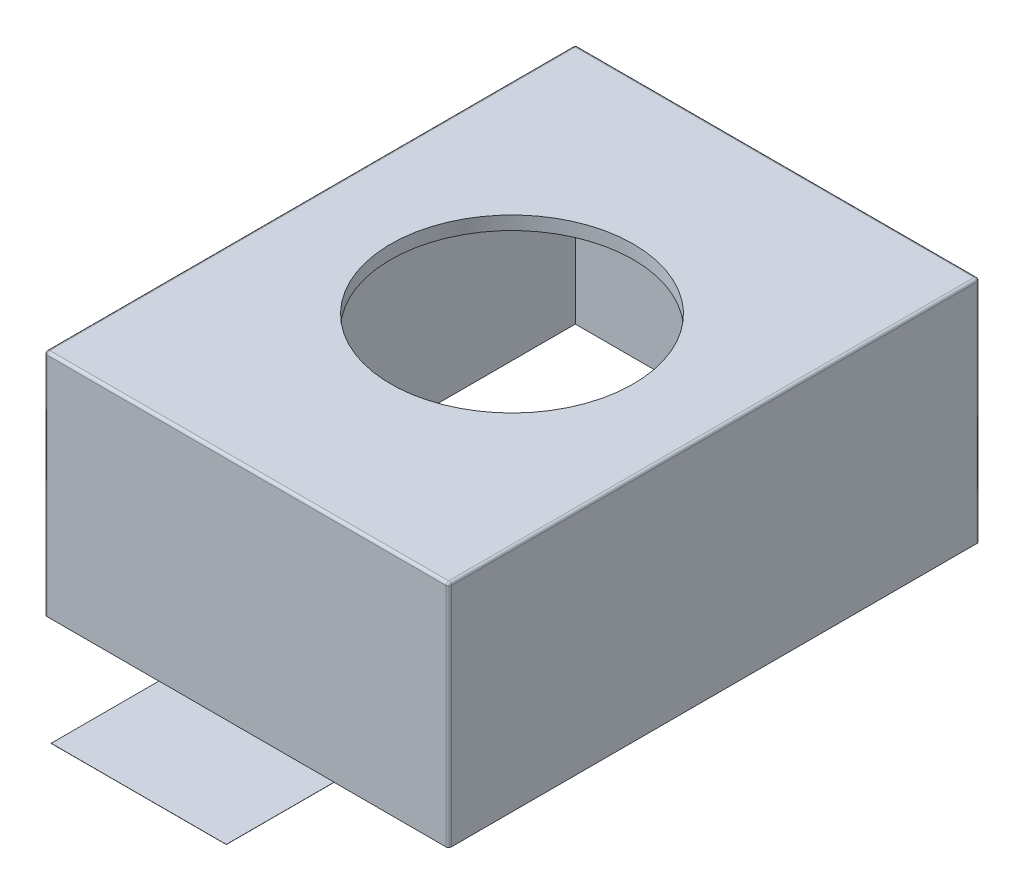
ISO-10303-21;
HEADER;
FILE_DESCRIPTION(('STEP AP214'),'2;1');
FILE_NAME('part.step','',(''),(''),'','','');
FILE_SCHEMA(('AUTOMOTIVE_DESIGN { 1 0 10303 214 1 1 1 1 }'));
ENDSEC;
DATA;
#1=APPLICATION_CONTEXT('core data for automotive mechanical design processes');
#2=APPLICATION_PROTOCOL_DEFINITION('international standard','automotive_design',2000,#1);
#3=PRODUCT_CONTEXT('',#1,'mechanical');
#4=PRODUCT('Part','Part','',(#3));
#5=PRODUCT_RELATED_PRODUCT_CATEGORY('part','',(#4));
#6=PRODUCT_DEFINITION_FORMATION('','',#4);
#7=PRODUCT_DEFINITION_CONTEXT('part definition',#1,'design');
#8=PRODUCT_DEFINITION('design','',#6,#7);
#9=PRODUCT_DEFINITION_SHAPE('','',#8);
#10=(LENGTH_UNIT() NAMED_UNIT(*) SI_UNIT(.MILLI.,.METRE.));
#11=(NAMED_UNIT(*) PLANE_ANGLE_UNIT() SI_UNIT($,.RADIAN.));
#12=(NAMED_UNIT(*) SI_UNIT($,.STERADIAN.) SOLID_ANGLE_UNIT());
#13=UNCERTAINTY_MEASURE_WITH_UNIT(LENGTH_MEASURE(1.E-05),#10,'distance_accuracy_value','');
#14=(GEOMETRIC_REPRESENTATION_CONTEXT(3) GLOBAL_UNCERTAINTY_ASSIGNED_CONTEXT((#13)) GLOBAL_UNIT_ASSIGNED_CONTEXT((#10,
#11,#12)) REPRESENTATION_CONTEXT('',''));
#15=CARTESIAN_POINT('',(0.,0.,0.));
#16=DIRECTION('',(0.,0.,1.));
#17=DIRECTION('',(1.,0.,0.));
#18=AXIS2_PLACEMENT_3D('',#15,#16,#17);
#19=CARTESIAN_POINT('',(5.6,1.65,23.8));
#20=DIRECTION('',(0.,0.,1.));
#21=DIRECTION('',(1.,0.,0.));
#22=AXIS2_PLACEMENT_3D('',#19,#20,#21);
#23=PLANE('',#22);
#24=DIRECTION('',(0.,1.,0.));
#25=VECTOR('',#24,1.);
#26=CARTESIAN_POINT('',(5.6,1.65,23.8));
#27=LINE('',#26,#25);
#28=CARTESIAN_POINT('',(5.6,1.65,23.8));
#29=VERTEX_POINT('',#28);
#30=CARTESIAN_POINT('',(5.6,1.651,23.8));
#31=VERTEX_POINT('',#30);
#32=EDGE_CURVE('E20',#29,#31,#27,.T.);
#33=ORIENTED_EDGE('',*,*,#32,.F.);
#34=DIRECTION('',(1.,0.,0.));
#35=VECTOR('',#34,1.);
#36=CARTESIAN_POINT('',(6.25,1.65,23.8));
#37=LINE('',#36,#35);
#38=CARTESIAN_POINT('',(6.9,1.65,23.8));
#39=VERTEX_POINT('',#38);
#40=EDGE_CURVE('E152',#29,#39,#37,.T.);
#41=ORIENTED_EDGE('',*,*,#40,.T.);
#42=DIRECTION('',(0.,1.,0.));
#43=VECTOR('',#42,1.);
#44=CARTESIAN_POINT('',(6.9,1.65,23.8));
#45=LINE('',#44,#43);
#46=CARTESIAN_POINT('',(6.9,1.651,23.8));
#47=VERTEX_POINT('',#46);
#48=EDGE_CURVE('E259',#47,#39,#45,.F.);
#49=ORIENTED_EDGE('',*,*,#48,.F.);
#50=DIRECTION('',(1.,0.,0.));
#51=VECTOR('',#50,1.);
#52=CARTESIAN_POINT('',(6.25,1.651,23.8));
#53=LINE('',#52,#51);
#54=EDGE_CURVE('E154',#47,#31,#53,.F.);
#55=ORIENTED_EDGE('',*,*,#54,.T.);
#56=EDGE_LOOP('',(#33,#41,#49,#55));
#57=FACE_BOUND('',#56,.T.);
#58=ADVANCED_FACE('F17',(#57),#23,.T.);
#59=CARTESIAN_POINT('',(6.9,1.65,18.26));
#60=DIRECTION('',(0.,0.,-1.));
#61=DIRECTION('',(-1.,0.,0.));
#62=AXIS2_PLACEMENT_3D('',#59,#60,#61);
#63=PLANE('',#62);
#64=DIRECTION('',(0.,1.,0.));
#65=VECTOR('',#64,1.);
#66=CARTESIAN_POINT('',(6.9,1.65,18.26));
#67=LINE('',#66,#65);
#68=CARTESIAN_POINT('',(6.9,1.65,18.26));
#69=VERTEX_POINT('',#68);
#70=CARTESIAN_POINT('',(6.9,1.651,18.26));
#71=VERTEX_POINT('',#70);
#72=EDGE_CURVE('E179',#69,#71,#67,.T.);
#73=ORIENTED_EDGE('',*,*,#72,.F.);
#74=DIRECTION('',(1.,0.,0.));
#75=VECTOR('',#74,1.);
#76=CARTESIAN_POINT('',(6.25,1.65,18.26));
#77=LINE('',#76,#75);
#78=CARTESIAN_POINT('',(5.6,1.65,18.26));
#79=VERTEX_POINT('',#78);
#80=EDGE_CURVE('E175',#69,#79,#77,.F.);
#81=ORIENTED_EDGE('',*,*,#80,.T.);
#82=DIRECTION('',(0.,1.,0.));
#83=VECTOR('',#82,1.);
#84=CARTESIAN_POINT('',(5.6,1.65,18.26));
#85=LINE('',#84,#83);
#86=CARTESIAN_POINT('',(5.6,1.651,18.26));
#87=VERTEX_POINT('',#86);
#88=EDGE_CURVE('E164',#87,#79,#85,.F.);
#89=ORIENTED_EDGE('',*,*,#88,.F.);
#90=DIRECTION('',(1.,0.,0.));
#91=VECTOR('',#90,1.);
#92=CARTESIAN_POINT('',(6.25,1.651,18.26));
#93=LINE('',#92,#91);
#94=EDGE_CURVE('E176',#87,#71,#93,.T.);
#95=ORIENTED_EDGE('',*,*,#94,.T.);
#96=EDGE_LOOP('',(#73,#81,#89,#95));
#97=FACE_BOUND('',#96,.T.);
#98=ADVANCED_FACE('F385',(#97),#63,.T.);
#99=CARTESIAN_POINT('',(5.6,1.65,23.));
#100=DIRECTION('',(-1.,0.,0.));
#101=DIRECTION('',(0.,0.,1.));
#102=AXIS2_PLACEMENT_3D('',#99,#100,#101);
#103=PLANE('',#102);
#104=DIRECTION('',(0.,1.,0.));
#105=VECTOR('',#104,1.);
#106=CARTESIAN_POINT('',(5.6,1.65,23.));
#107=LINE('',#106,#105);
#108=CARTESIAN_POINT('',(5.6,1.65,23.));
#109=VERTEX_POINT('',#108);
#110=CARTESIAN_POINT('',(5.6,1.651,23.));
#111=VERTEX_POINT('',#110);
#112=EDGE_CURVE('E161',#109,#111,#107,.T.);
#113=ORIENTED_EDGE('',*,*,#112,.F.);
#114=DIRECTION('',(0.,0.,1.));
#115=VECTOR('',#114,1.);
#116=CARTESIAN_POINT('',(5.6,1.65,21.03));
#117=LINE('',#116,#115);
#118=EDGE_CURVE('E158',#109,#29,#117,.T.);
#119=ORIENTED_EDGE('',*,*,#118,.T.);
#120=ORIENTED_EDGE('',*,*,#32,.T.);
#121=DIRECTION('',(0.,0.,-1.));
#122=VECTOR('',#121,1.);
#123=CARTESIAN_POINT('',(5.6,1.651,18.66));
#124=LINE('',#123,#122);
#125=EDGE_CURVE('E180',#31,#111,#124,.T.);
#126=ORIENTED_EDGE('',*,*,#125,.T.);
#127=EDGE_LOOP('',(#113,#119,#120,#126));
#128=FACE_BOUND('',#127,.T.);
#129=ADVANCED_FACE('F159',(#128),#103,.T.);
#130=CARTESIAN_POINT('',(6.25,1.651,18.66));
#131=DIRECTION('',(0.,-1.,0.));
#132=DIRECTION('',(0.,0.,-1.));
#133=AXIS2_PLACEMENT_3D('',#130,#131,#132);
#134=PLANE('',#133);
#135=ORIENTED_EDGE('',*,*,#54,.F.);
#136=DIRECTION('',(0.,0.,-1.));
#137=VECTOR('',#136,1.);
#138=CARTESIAN_POINT('',(6.9,1.651,23.8));
#139=LINE('',#138,#137);
#140=CARTESIAN_POINT('',(6.9,1.651,23.));
#141=VERTEX_POINT('',#140);
#142=EDGE_CURVE('E260',#141,#47,#139,.F.);
#143=ORIENTED_EDGE('',*,*,#142,.F.);
#144=DIRECTION('',(1.,0.,0.));
#145=VECTOR('',#144,1.);
#146=CARTESIAN_POINT('',(4.75,1.651,23.));
#147=LINE('',#146,#145);
#148=EDGE_CURVE('E239',#111,#141,#147,.T.);
#149=ORIENTED_EDGE('',*,*,#148,.F.);
#150=ORIENTED_EDGE('',*,*,#125,.F.);
#151=EDGE_LOOP('',(#135,#143,#149,#150));
#152=FACE_BOUND('',#151,.T.);
#153=ADVANCED_FACE('F380',(#152),#134,.F.);
#154=CARTESIAN_POINT('',(6.9,1.65,23.8));
#155=DIRECTION('',(1.,0.,0.));
#156=DIRECTION('',(0.,0.,-1.));
#157=AXIS2_PLACEMENT_3D('',#154,#155,#156);
#158=PLANE('',#157);
#159=ORIENTED_EDGE('',*,*,#48,.T.);
#160=DIRECTION('',(0.,0.,1.));
#161=VECTOR('',#160,1.);
#162=CARTESIAN_POINT('',(6.9,1.65,21.03));
#163=LINE('',#162,#161);
#164=CARTESIAN_POINT('',(6.9,1.65,23.));
#165=VERTEX_POINT('',#164);
#166=EDGE_CURVE('E169',#39,#165,#163,.F.);
#167=ORIENTED_EDGE('',*,*,#166,.T.);
#168=DIRECTION('',(0.,1.,0.));
#169=VECTOR('',#168,1.);
#170=CARTESIAN_POINT('',(6.9,1.65,23.));
#171=LINE('',#170,#169);
#172=EDGE_CURVE('E235',#141,#165,#171,.F.);
#173=ORIENTED_EDGE('',*,*,#172,.F.);
#174=ORIENTED_EDGE('',*,*,#142,.T.);
#175=EDGE_LOOP('',(#159,#167,#173,#174));
#176=FACE_BOUND('',#175,.T.);
#177=ADVANCED_FACE('F376',(#176),#158,.T.);
#178=CARTESIAN_POINT('',(7.73,1.65,22.98));
#179=DIRECTION('',(0.,1.,0.));
#180=DIRECTION('',(0.,0.,1.));
#181=AXIS2_PLACEMENT_3D('',#178,#179,#180);
#182=CYLINDRICAL_SURFACE('',#181,0.02);
#183=DIRECTION('',(0.,1.,0.));
#184=VECTOR('',#183,1.);
#185=CARTESIAN_POINT('',(7.73,1.65,23.));
#186=LINE('',#185,#184);
#187=CARTESIAN_POINT('',(7.73,1.65,23.));
#188=VERTEX_POINT('',#187);
#189=CARTESIAN_POINT('',(7.73,3.33,23.));
#190=VERTEX_POINT('',#189);
#191=EDGE_CURVE('E305',#188,#190,#186,.T.);
#192=ORIENTED_EDGE('',*,*,#191,.F.);
#193=CARTESIAN_POINT('',(7.73,1.65,22.98));
#194=DIRECTION('',(0.,1.,0.));
#195=DIRECTION('',(0.,0.,1.));
#196=AXIS2_PLACEMENT_3D('',#193,#194,#195);
#197=CIRCLE('',#196,0.02);
#198=CARTESIAN_POINT('',(7.75,1.65,22.98));
#199=VERTEX_POINT('',#198);
#200=EDGE_CURVE('E171',#188,#199,#197,.T.);
#201=ORIENTED_EDGE('',*,*,#200,.T.);
#202=DIRECTION('',(0.,1.,0.));
#203=VECTOR('',#202,1.);
#204=CARTESIAN_POINT('',(7.75,1.65,22.98));
#205=LINE('',#204,#203);
#206=CARTESIAN_POINT('',(7.75,3.33,22.98));
#207=VERTEX_POINT('',#206);
#208=EDGE_CURVE('E229',#207,#199,#205,.F.);
#209=ORIENTED_EDGE('',*,*,#208,.F.);
#210=CARTESIAN_POINT('',(7.73,3.33,22.98));
#211=DIRECTION('',(0.,1.,0.));
#212=DIRECTION('',(0.,0.,1.));
#213=AXIS2_PLACEMENT_3D('',#210,#211,#212);
#214=CIRCLE('',#213,0.02);
#215=EDGE_CURVE('E230',#190,#207,#214,.T.);
#216=ORIENTED_EDGE('',*,*,#215,.F.);
#217=EDGE_LOOP('',(#192,#201,#209,#216));
#218=FACE_BOUND('',#217,.T.);
#219=ADVANCED_FACE('F372',(#218),#182,.T.);
#220=CARTESIAN_POINT('',(7.73,1.65,19.08));
#221=DIRECTION('',(0.,1.,0.));
#222=DIRECTION('',(0.,0.,1.));
#223=AXIS2_PLACEMENT_3D('',#220,#221,#222);
#224=CYLINDRICAL_SURFACE('',#223,0.02);
#225=DIRECTION('',(0.,1.,0.));
#226=VECTOR('',#225,1.);
#227=CARTESIAN_POINT('',(7.75,1.65,19.08));
#228=LINE('',#227,#226);
#229=CARTESIAN_POINT('',(7.75,1.65,19.08));
#230=VERTEX_POINT('',#229);
#231=CARTESIAN_POINT('',(7.75,3.33,19.08));
#232=VERTEX_POINT('',#231);
#233=EDGE_CURVE('E269',#230,#232,#228,.T.);
#234=ORIENTED_EDGE('',*,*,#233,.F.);
#235=CARTESIAN_POINT('',(7.73,1.65,19.08));
#236=DIRECTION('',(0.,1.,0.));
#237=DIRECTION('',(0.,0.,1.));
#238=AXIS2_PLACEMENT_3D('',#235,#236,#237);
#239=CIRCLE('',#238,0.02);
#240=CARTESIAN_POINT('',(7.73,1.65,19.06));
#241=VERTEX_POINT('',#240);
#242=EDGE_CURVE('E251',#230,#241,#239,.T.);
#243=ORIENTED_EDGE('',*,*,#242,.T.);
#244=DIRECTION('',(0.,1.,0.));
#245=VECTOR('',#244,1.);
#246=CARTESIAN_POINT('',(7.73,1.65,19.06));
#247=LINE('',#246,#245);
#248=CARTESIAN_POINT('',(7.73,3.33,19.06));
#249=VERTEX_POINT('',#248);
#250=EDGE_CURVE('E228',#249,#241,#247,.F.);
#251=ORIENTED_EDGE('',*,*,#250,.F.);
#252=CARTESIAN_POINT('',(7.73,3.33,19.08));
#253=DIRECTION('',(0.,1.,0.));
#254=DIRECTION('',(0.,0.,1.));
#255=AXIS2_PLACEMENT_3D('',#252,#253,#254);
#256=CIRCLE('',#255,0.02);
#257=EDGE_CURVE('E225',#232,#249,#256,.T.);
#258=ORIENTED_EDGE('',*,*,#257,.F.);
#259=EDGE_LOOP('',(#234,#243,#251,#258));
#260=FACE_BOUND('',#259,.T.);
#261=ADVANCED_FACE('F368',(#260),#224,.T.);
#262=CARTESIAN_POINT('',(6.9,1.65,19.06));
#263=DIRECTION('',(1.,0.,0.));
#264=DIRECTION('',(0.,0.,-1.));
#265=AXIS2_PLACEMENT_3D('',#262,#263,#264);
#266=PLANE('',#265);
#267=DIRECTION('',(0.,1.,0.));
#268=VECTOR('',#267,1.);
#269=CARTESIAN_POINT('',(6.9,1.65,19.06));
#270=LINE('',#269,#268);
#271=CARTESIAN_POINT('',(6.9,1.65,19.06));
#272=VERTEX_POINT('',#271);
#273=CARTESIAN_POINT('',(6.9,1.651,19.06));
#274=VERTEX_POINT('',#273);
#275=EDGE_CURVE('E221',#272,#274,#270,.T.);
#276=ORIENTED_EDGE('',*,*,#275,.F.);
#277=DIRECTION('',(0.,0.,1.));
#278=VECTOR('',#277,1.);
#279=CARTESIAN_POINT('',(6.9,1.65,21.03));
#280=LINE('',#279,#278);
#281=EDGE_CURVE('E253',#272,#69,#280,.F.);
#282=ORIENTED_EDGE('',*,*,#281,.T.);
#283=ORIENTED_EDGE('',*,*,#72,.T.);
#284=DIRECTION('',(0.,0.,-1.));
#285=VECTOR('',#284,1.);
#286=CARTESIAN_POINT('',(6.9,1.651,18.66));
#287=LINE('',#286,#285);
#288=EDGE_CURVE('E178',#71,#274,#287,.F.);
#289=ORIENTED_EDGE('',*,*,#288,.T.);
#290=EDGE_LOOP('',(#276,#282,#283,#289));
#291=FACE_BOUND('',#290,.T.);
#292=ADVANCED_FACE('F364',(#291),#266,.T.);
#293=CARTESIAN_POINT('',(6.25,1.651,18.66));
#294=DIRECTION('',(0.,-1.,0.));
#295=DIRECTION('',(0.,0.,-1.));
#296=AXIS2_PLACEMENT_3D('',#293,#294,#295);
#297=PLANE('',#296);
#298=ORIENTED_EDGE('',*,*,#94,.F.);
#299=DIRECTION('',(0.,0.,1.));
#300=VECTOR('',#299,1.);
#301=CARTESIAN_POINT('',(5.6,1.651,18.26));
#302=LINE('',#301,#300);
#303=CARTESIAN_POINT('',(5.6,1.651,19.06));
#304=VERTEX_POINT('',#303);
#305=EDGE_CURVE('E257',#304,#87,#302,.F.);
#306=ORIENTED_EDGE('',*,*,#305,.F.);
#307=DIRECTION('',(-1.,0.,0.));
#308=VECTOR('',#307,1.);
#309=CARTESIAN_POINT('',(7.75,1.651,19.06));
#310=LINE('',#309,#308);
#311=EDGE_CURVE('E220',#274,#304,#310,.T.);
#312=ORIENTED_EDGE('',*,*,#311,.F.);
#313=ORIENTED_EDGE('',*,*,#288,.F.);
#314=EDGE_LOOP('',(#298,#306,#312,#313));
#315=FACE_BOUND('',#314,.T.);
#316=ADVANCED_FACE('F360',(#315),#297,.F.);
#317=CARTESIAN_POINT('',(5.6,1.65,18.26));
#318=DIRECTION('',(-1.,0.,0.));
#319=DIRECTION('',(0.,0.,1.));
#320=AXIS2_PLACEMENT_3D('',#317,#318,#319);
#321=PLANE('',#320);
#322=ORIENTED_EDGE('',*,*,#88,.T.);
#323=DIRECTION('',(0.,0.,1.));
#324=VECTOR('',#323,1.);
#325=CARTESIAN_POINT('',(5.6,1.65,21.03));
#326=LINE('',#325,#324);
#327=CARTESIAN_POINT('',(5.6,1.65,19.06));
#328=VERTEX_POINT('',#327);
#329=EDGE_CURVE('E250',#79,#328,#326,.T.);
#330=ORIENTED_EDGE('',*,*,#329,.T.);
#331=DIRECTION('',(0.,1.,0.));
#332=VECTOR('',#331,1.);
#333=CARTESIAN_POINT('',(5.6,1.65,19.06));
#334=LINE('',#333,#332);
#335=EDGE_CURVE('E216',#304,#328,#334,.F.);
#336=ORIENTED_EDGE('',*,*,#335,.F.);
#337=ORIENTED_EDGE('',*,*,#305,.T.);
#338=EDGE_LOOP('',(#322,#330,#336,#337));
#339=FACE_BOUND('',#338,.T.);
#340=ADVANCED_FACE('F356',(#339),#321,.T.);
#341=CARTESIAN_POINT('',(4.77,1.65,19.08));
#342=DIRECTION('',(0.,1.,0.));
#343=DIRECTION('',(0.,0.,1.));
#344=AXIS2_PLACEMENT_3D('',#341,#342,#343);
#345=CYLINDRICAL_SURFACE('',#344,0.02);
#346=DIRECTION('',(0.,1.,0.));
#347=VECTOR('',#346,1.);
#348=CARTESIAN_POINT('',(4.77,1.65,19.06));
#349=LINE('',#348,#347);
#350=CARTESIAN_POINT('',(4.77,1.65,19.06));
#351=VERTEX_POINT('',#350);
#352=CARTESIAN_POINT('',(4.77,3.33,19.06));
#353=VERTEX_POINT('',#352);
#354=EDGE_CURVE('E215',#351,#353,#349,.T.);
#355=ORIENTED_EDGE('',*,*,#354,.F.);
#356=CARTESIAN_POINT('',(4.77,1.65,19.08));
#357=DIRECTION('',(0.,1.,0.));
#358=DIRECTION('',(0.,0.,1.));
#359=AXIS2_PLACEMENT_3D('',#356,#357,#358);
#360=CIRCLE('',#359,0.02);
#361=CARTESIAN_POINT('',(4.75,1.65,19.08));
#362=VERTEX_POINT('',#361);
#363=EDGE_CURVE('E248',#351,#362,#360,.T.);
#364=ORIENTED_EDGE('',*,*,#363,.T.);
#365=DIRECTION('',(0.,1.,0.));
#366=VECTOR('',#365,1.);
#367=CARTESIAN_POINT('',(4.75,1.65,19.08));
#368=LINE('',#367,#366);
#369=CARTESIAN_POINT('',(4.75,3.33,19.08));
#370=VERTEX_POINT('',#369);
#371=EDGE_CURVE('E214',#370,#362,#368,.F.);
#372=ORIENTED_EDGE('',*,*,#371,.F.);
#373=CARTESIAN_POINT('',(4.77,3.33,19.08));
#374=DIRECTION('',(0.,1.,0.));
#375=DIRECTION('',(0.,0.,1.));
#376=AXIS2_PLACEMENT_3D('',#373,#374,#375);
#377=CIRCLE('',#376,0.02);
#378=EDGE_CURVE('E211',#353,#370,#377,.T.);
#379=ORIENTED_EDGE('',*,*,#378,.F.);
#380=EDGE_LOOP('',(#355,#364,#372,#379));
#381=FACE_BOUND('',#380,.T.);
#382=ADVANCED_FACE('F352',(#381),#345,.T.);
#383=CARTESIAN_POINT('',(6.25,1.65,21.03));
#384=DIRECTION('',(0.,1.,0.));
#385=DIRECTION('',(0.,0.,1.));
#386=AXIS2_PLACEMENT_3D('',#383,#384,#385);
#387=PLANE('',#386);
#388=DIRECTION('',(1.,0.,0.));
#389=VECTOR('',#388,1.);
#390=CARTESIAN_POINT('',(4.75,1.65,22.9));
#391=LINE('',#390,#389);
#392=CARTESIAN_POINT('',(4.85,1.65,22.9));
#393=VERTEX_POINT('',#392);
#394=CARTESIAN_POINT('',(7.65,1.65,22.9));
#395=VERTEX_POINT('',#394);
#396=EDGE_CURVE('E245',#393,#395,#391,.T.);
#397=ORIENTED_EDGE('',*,*,#396,.T.);
#398=DIRECTION('',(0.,0.,-1.));
#399=VECTOR('',#398,1.);
#400=CARTESIAN_POINT('',(7.65,1.65,23.));
#401=LINE('',#400,#399);
#402=CARTESIAN_POINT('',(7.65,1.65,19.16));
#403=VERTEX_POINT('',#402);
#404=EDGE_CURVE('E285',#395,#403,#401,.T.);
#405=ORIENTED_EDGE('',*,*,#404,.T.);
#406=DIRECTION('',(-1.,0.,0.));
#407=VECTOR('',#406,1.);
#408=CARTESIAN_POINT('',(7.75,1.65,19.16));
#409=LINE('',#408,#407);
#410=CARTESIAN_POINT('',(4.85,1.65,19.16));
#411=VERTEX_POINT('',#410);
#412=EDGE_CURVE('E288',#403,#411,#409,.T.);
#413=ORIENTED_EDGE('',*,*,#412,.T.);
#414=DIRECTION('',(0.,0.,1.));
#415=VECTOR('',#414,1.);
#416=CARTESIAN_POINT('',(4.85,1.65,19.06));
#417=LINE('',#416,#415);
#418=EDGE_CURVE('E300',#411,#393,#417,.T.);
#419=ORIENTED_EDGE('',*,*,#418,.T.);
#420=EDGE_LOOP('',(#397,#405,#413,#419));
#421=FACE_BOUND('',#420,.T.);
#422=ORIENTED_EDGE('',*,*,#363,.F.);
#423=DIRECTION('',(-1.,0.,0.));
#424=VECTOR('',#423,1.);
#425=CARTESIAN_POINT('',(7.75,1.65,19.06));
#426=LINE('',#425,#424);
#427=EDGE_CURVE('E219',#328,#351,#426,.T.);
#428=ORIENTED_EDGE('',*,*,#427,.F.);
#429=ORIENTED_EDGE('',*,*,#329,.F.);
#430=ORIENTED_EDGE('',*,*,#80,.F.);
#431=ORIENTED_EDGE('',*,*,#281,.F.);
#432=DIRECTION('',(-1.,0.,0.));
#433=VECTOR('',#432,1.);
#434=CARTESIAN_POINT('',(7.75,1.65,19.06));
#435=LINE('',#434,#433);
#436=EDGE_CURVE('E224',#241,#272,#435,.T.);
#437=ORIENTED_EDGE('',*,*,#436,.F.);
#438=ORIENTED_EDGE('',*,*,#242,.F.);
#439=DIRECTION('',(0.,0.,-1.));
#440=VECTOR('',#439,1.);
#441=CARTESIAN_POINT('',(7.75,1.65,23.));
#442=LINE('',#441,#440);
#443=EDGE_CURVE('E233',#199,#230,#442,.T.);
#444=ORIENTED_EDGE('',*,*,#443,.F.);
#445=ORIENTED_EDGE('',*,*,#200,.F.);
#446=DIRECTION('',(1.,0.,0.));
#447=VECTOR('',#446,1.);
#448=CARTESIAN_POINT('',(4.75,1.65,23.));
#449=LINE('',#448,#447);
#450=EDGE_CURVE('E238',#165,#188,#449,.T.);
#451=ORIENTED_EDGE('',*,*,#450,.F.);
#452=ORIENTED_EDGE('',*,*,#166,.F.);
#453=ORIENTED_EDGE('',*,*,#40,.F.);
#454=ORIENTED_EDGE('',*,*,#118,.F.);
#455=DIRECTION('',(1.,0.,0.));
#456=VECTOR('',#455,1.);
#457=CARTESIAN_POINT('',(4.75,1.65,23.));
#458=LINE('',#457,#456);
#459=CARTESIAN_POINT('',(4.77,1.65,23.));
#460=VERTEX_POINT('',#459);
#461=EDGE_CURVE('E241',#460,#109,#458,.T.);
#462=ORIENTED_EDGE('',*,*,#461,.F.);
#463=CARTESIAN_POINT('',(4.77,1.65,22.98));
#464=DIRECTION('',(0.,1.,0.));
#465=DIRECTION('',(0.,0.,1.));
#466=AXIS2_PLACEMENT_3D('',#463,#464,#465);
#467=CIRCLE('',#466,0.02);
#468=CARTESIAN_POINT('',(4.75,1.65,22.98));
#469=VERTEX_POINT('',#468);
#470=EDGE_CURVE('E242',#469,#460,#467,.T.);
#471=ORIENTED_EDGE('',*,*,#470,.F.);
#472=DIRECTION('',(0.,0.,1.));
#473=VECTOR('',#472,1.);
#474=CARTESIAN_POINT('',(4.75,1.65,19.06));
#475=LINE('',#474,#473);
#476=EDGE_CURVE('E276',#362,#469,#475,.T.);
#477=ORIENTED_EDGE('',*,*,#476,.F.);
#478=EDGE_LOOP('',(#422,#428,#429,#430,#431,#437,#438,#444,#445,#451,#452,#453,#454,#462,#471,#477));
#479=FACE_BOUND('',#478,.T.);
#480=ADVANCED_FACE('F167',(#421,#479),#387,.F.);
#481=CARTESIAN_POINT('',(4.77,1.65,22.98));
#482=DIRECTION('',(0.,1.,0.));
#483=DIRECTION('',(0.,0.,1.));
#484=AXIS2_PLACEMENT_3D('',#481,#482,#483);
#485=CYLINDRICAL_SURFACE('',#484,0.02);
#486=DIRECTION('',(0.,1.,0.));
#487=VECTOR('',#486,1.);
#488=CARTESIAN_POINT('',(4.75,1.65,22.98));
#489=LINE('',#488,#487);
#490=CARTESIAN_POINT('',(4.75,3.33,22.98));
#491=VERTEX_POINT('',#490);
#492=EDGE_CURVE('E279',#469,#491,#489,.T.);
#493=ORIENTED_EDGE('',*,*,#492,.F.);
#494=ORIENTED_EDGE('',*,*,#470,.T.);
#495=DIRECTION('',(0.,1.,0.));
#496=VECTOR('',#495,1.);
#497=CARTESIAN_POINT('',(4.77,1.65,23.));
#498=LINE('',#497,#496);
#499=CARTESIAN_POINT('',(4.77,3.33,23.));
#500=VERTEX_POINT('',#499);
#501=EDGE_CURVE('E234',#500,#460,#498,.F.);
#502=ORIENTED_EDGE('',*,*,#501,.F.);
#503=CARTESIAN_POINT('',(4.77,3.33,22.98));
#504=DIRECTION('',(0.,1.,0.));
#505=DIRECTION('',(0.,0.,1.));
#506=AXIS2_PLACEMENT_3D('',#503,#504,#505);
#507=CIRCLE('',#506,0.02);
#508=EDGE_CURVE('E246',#500,#491,#507,.F.);
#509=ORIENTED_EDGE('',*,*,#508,.T.);
#510=EDGE_LOOP('',(#493,#494,#502,#509));
#511=FACE_BOUND('',#510,.T.);
#512=ADVANCED_FACE('F345',(#511),#485,.T.);
#513=CARTESIAN_POINT('',(4.75,1.65,22.9));
#514=DIRECTION('',(0.,0.,1.));
#515=DIRECTION('',(1.,0.,0.));
#516=AXIS2_PLACEMENT_3D('',#513,#514,#515);
#517=PLANE('',#516);
#518=DIRECTION('',(1.,0.,0.));
#519=VECTOR('',#518,1.);
#520=CARTESIAN_POINT('',(6.25,3.25,22.9));
#521=LINE('',#520,#519);
#522=CARTESIAN_POINT('',(4.85,3.25,22.9));
#523=VERTEX_POINT('',#522);
#524=CARTESIAN_POINT('',(7.65,3.25,22.9));
#525=VERTEX_POINT('',#524);
#526=EDGE_CURVE('E433',#523,#525,#521,.T.);
#527=ORIENTED_EDGE('',*,*,#526,.T.);
#528=DIRECTION('',(0.,1.,0.));
#529=VECTOR('',#528,1.);
#530=CARTESIAN_POINT('',(7.65,1.65,22.9));
#531=LINE('',#530,#529);
#532=EDGE_CURVE('E282',#525,#395,#531,.F.);
#533=ORIENTED_EDGE('',*,*,#532,.T.);
#534=ORIENTED_EDGE('',*,*,#396,.F.);
#535=DIRECTION('',(0.,1.,0.));
#536=VECTOR('',#535,1.);
#537=CARTESIAN_POINT('',(4.85,1.65,22.9));
#538=LINE('',#537,#536);
#539=EDGE_CURVE('E294',#393,#523,#538,.T.);
#540=ORIENTED_EDGE('',*,*,#539,.T.);
#541=EDGE_LOOP('',(#527,#533,#534,#540));
#542=FACE_BOUND('',#541,.T.);
#543=ADVANCED_FACE('F341',(#542),#517,.F.);
#544=CARTESIAN_POINT('',(7.65,1.65,23.));
#545=DIRECTION('',(1.,0.,0.));
#546=DIRECTION('',(0.,0.,-1.));
#547=AXIS2_PLACEMENT_3D('',#544,#545,#546);
#548=PLANE('',#547);
#549=ORIENTED_EDGE('',*,*,#532,.F.);
#550=DIRECTION('',(0.,0.,1.));
#551=VECTOR('',#550,1.);
#552=CARTESIAN_POINT('',(7.65,3.25,21.03));
#553=LINE('',#552,#551);
#554=CARTESIAN_POINT('',(7.65,3.25,19.16));
#555=VERTEX_POINT('',#554);
#556=EDGE_CURVE('E734',#525,#555,#553,.F.);
#557=ORIENTED_EDGE('',*,*,#556,.T.);
#558=DIRECTION('',(0.,1.,0.));
#559=VECTOR('',#558,1.);
#560=CARTESIAN_POINT('',(7.65,1.65,19.16));
#561=LINE('',#560,#559);
#562=EDGE_CURVE('E291',#555,#403,#561,.F.);
#563=ORIENTED_EDGE('',*,*,#562,.T.);
#564=ORIENTED_EDGE('',*,*,#404,.F.);
#565=EDGE_LOOP('',(#549,#557,#563,#564));
#566=FACE_BOUND('',#565,.T.);
#567=ADVANCED_FACE('F337',(#566),#548,.F.);
#568=CARTESIAN_POINT('',(7.75,1.65,19.16));
#569=DIRECTION('',(0.,0.,-1.));
#570=DIRECTION('',(-1.,0.,0.));
#571=AXIS2_PLACEMENT_3D('',#568,#569,#570);
#572=PLANE('',#571);
#573=DIRECTION('',(1.,0.,0.));
#574=VECTOR('',#573,1.);
#575=CARTESIAN_POINT('',(6.25,3.25,19.16));
#576=LINE('',#575,#574);
#577=CARTESIAN_POINT('',(4.85,3.25,19.16));
#578=VERTEX_POINT('',#577);
#579=EDGE_CURVE('E738',#555,#578,#576,.F.);
#580=ORIENTED_EDGE('',*,*,#579,.T.);
#581=DIRECTION('',(0.,1.,0.));
#582=VECTOR('',#581,1.);
#583=CARTESIAN_POINT('',(4.85,1.65,19.16));
#584=LINE('',#583,#582);
#585=EDGE_CURVE('E297',#578,#411,#584,.F.);
#586=ORIENTED_EDGE('',*,*,#585,.T.);
#587=ORIENTED_EDGE('',*,*,#412,.F.);
#588=ORIENTED_EDGE('',*,*,#562,.F.);
#589=EDGE_LOOP('',(#580,#586,#587,#588));
#590=FACE_BOUND('',#589,.T.);
#591=ADVANCED_FACE('F333',(#590),#572,.F.);
#592=CARTESIAN_POINT('',(4.85,1.65,19.06));
#593=DIRECTION('',(-1.,0.,0.));
#594=DIRECTION('',(0.,0.,1.));
#595=AXIS2_PLACEMENT_3D('',#592,#593,#594);
#596=PLANE('',#595);
#597=ORIENTED_EDGE('',*,*,#585,.F.);
#598=DIRECTION('',(0.,0.,1.));
#599=VECTOR('',#598,1.);
#600=CARTESIAN_POINT('',(4.85,3.25,21.03));
#601=LINE('',#600,#599);
#602=EDGE_CURVE('E210',#578,#523,#601,.T.);
#603=ORIENTED_EDGE('',*,*,#602,.T.);
#604=ORIENTED_EDGE('',*,*,#539,.F.);
#605=ORIENTED_EDGE('',*,*,#418,.F.);
#606=EDGE_LOOP('',(#597,#603,#604,#605));
#607=FACE_BOUND('',#606,.T.);
#608=ADVANCED_FACE('F329',(#607),#596,.F.);
#609=CARTESIAN_POINT('',(4.75,1.65,23.));
#610=DIRECTION('',(0.,0.,1.));
#611=DIRECTION('',(1.,0.,0.));
#612=AXIS2_PLACEMENT_3D('',#609,#610,#611);
#613=PLANE('',#612);
#614=DIRECTION('',(1.,0.,0.));
#615=VECTOR('',#614,1.);
#616=CARTESIAN_POINT('',(5.5,3.33,23.));
#617=LINE('',#616,#615);
#618=EDGE_CURVE('E206',#500,#190,#617,.T.);
#619=ORIENTED_EDGE('',*,*,#618,.F.);
#620=ORIENTED_EDGE('',*,*,#501,.T.);
#621=ORIENTED_EDGE('',*,*,#461,.T.);
#622=ORIENTED_EDGE('',*,*,#112,.T.);
#623=ORIENTED_EDGE('',*,*,#148,.T.);
#624=ORIENTED_EDGE('',*,*,#172,.T.);
#625=ORIENTED_EDGE('',*,*,#450,.T.);
#626=ORIENTED_EDGE('',*,*,#191,.T.);
#627=EDGE_LOOP('',(#619,#620,#621,#622,#623,#624,#625,#626));
#628=FACE_BOUND('',#627,.T.);
#629=ADVANCED_FACE('F324',(#628),#613,.T.);
#630=CARTESIAN_POINT('',(7.73,3.33,22.98));
#631=DIRECTION('',(0.577350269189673,0.577350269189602,0.577350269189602));
#632=DIRECTION('',(0.,0.707106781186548,-0.707106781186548));
#633=AXIS2_PLACEMENT_3D('',#630,#631,#632);
#634=SPHERICAL_SURFACE('',#633,0.02);
#635=CARTESIAN_POINT('',(7.74154700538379,3.34154700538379,22.9915470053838));
#636=VERTEX_POINT('',#635);
#637=VERTEX_LOOP('',#636);
#638=FACE_BOUND('',#637,.T.);
#639=CARTESIAN_POINT('',(7.73,3.33,22.98));
#640=DIRECTION('',(0.,0.,-1.));
#641=DIRECTION('',(-1.,0.,0.));
#642=AXIS2_PLACEMENT_3D('',#639,#640,#641);
#643=CIRCLE('',#642,0.02);
#644=CARTESIAN_POINT('',(7.73,3.35,22.98));
#645=VERTEX_POINT('',#644);
#646=EDGE_CURVE('E201',#645,#207,#643,.T.);
#647=ORIENTED_EDGE('',*,*,#646,.F.);
#648=CARTESIAN_POINT('',(7.73,3.33,22.98));
#649=DIRECTION('',(1.,0.,0.));
#650=DIRECTION('',(0.,0.,-1.));
#651=AXIS2_PLACEMENT_3D('',#648,#649,#650);
#652=CIRCLE('',#651,0.02);
#653=EDGE_CURVE('E204',#190,#645,#652,.F.);
#654=ORIENTED_EDGE('',*,*,#653,.F.);
#655=ORIENTED_EDGE('',*,*,#215,.T.);
#656=EDGE_LOOP('',(#647,#654,#655));
#657=FACE_BOUND('',#656,.T.);
#658=ADVANCED_FACE('F319',(#638,#657),#634,.T.);
#659=CARTESIAN_POINT('',(7.75,1.65,23.));
#660=DIRECTION('',(1.,0.,0.));
#661=DIRECTION('',(0.,0.,-1.));
#662=AXIS2_PLACEMENT_3D('',#659,#660,#661);
#663=PLANE('',#662);
#664=DIRECTION('',(0.,0.,-1.));
#665=VECTOR('',#664,1.);
#666=CARTESIAN_POINT('',(7.75,3.33,22.015));
#667=LINE('',#666,#665);
#668=EDGE_CURVE('E200',#207,#232,#667,.T.);
#669=ORIENTED_EDGE('',*,*,#668,.F.);
#670=ORIENTED_EDGE('',*,*,#208,.T.);
#671=ORIENTED_EDGE('',*,*,#443,.T.);
#672=ORIENTED_EDGE('',*,*,#233,.T.);
#673=EDGE_LOOP('',(#669,#670,#671,#672));
#674=FACE_BOUND('',#673,.T.);
#675=ADVANCED_FACE('F323',(#674),#663,.T.);
#676=CARTESIAN_POINT('',(7.73,3.33,19.08));
#677=DIRECTION('',(0.577350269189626,0.577350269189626,-0.577350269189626));
#678=DIRECTION('',(0.707106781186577,0.,0.707106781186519));
#679=AXIS2_PLACEMENT_3D('',#676,#677,#678);
#680=SPHERICAL_SURFACE('',#679,0.02);
#681=CARTESIAN_POINT('',(7.74154700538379,3.34154700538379,19.0684529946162));
#682=VERTEX_POINT('',#681);
#683=VERTEX_LOOP('',#682);
#684=FACE_BOUND('',#683,.T.);
#685=CARTESIAN_POINT('',(7.73,3.33,19.08));
#686=DIRECTION('',(-1.,0.,0.));
#687=DIRECTION('',(0.,0.,1.));
#688=AXIS2_PLACEMENT_3D('',#685,#686,#687);
#689=CIRCLE('',#688,0.02);
#690=CARTESIAN_POINT('',(7.73,3.35,19.08));
#691=VERTEX_POINT('',#690);
#692=EDGE_CURVE('E195',#691,#249,#689,.T.);
#693=ORIENTED_EDGE('',*,*,#692,.F.);
#694=CARTESIAN_POINT('',(7.73,3.33,19.08));
#695=DIRECTION('',(0.,0.,-1.));
#696=DIRECTION('',(-1.,0.,0.));
#697=AXIS2_PLACEMENT_3D('',#694,#695,#696);
#698=CIRCLE('',#697,0.02);
#699=EDGE_CURVE('E198',#232,#691,#698,.F.);
#700=ORIENTED_EDGE('',*,*,#699,.F.);
#701=ORIENTED_EDGE('',*,*,#257,.T.);
#702=EDGE_LOOP('',(#693,#700,#701));
#703=FACE_BOUND('',#702,.T.);
#704=ADVANCED_FACE('F450',(#684,#703),#680,.T.);
#705=CARTESIAN_POINT('',(7.75,1.65,19.06));
#706=DIRECTION('',(0.,0.,-1.));
#707=DIRECTION('',(-1.,0.,0.));
#708=AXIS2_PLACEMENT_3D('',#705,#706,#707);
#709=PLANE('',#708);
#710=ORIENTED_EDGE('',*,*,#427,.T.);
#711=ORIENTED_EDGE('',*,*,#354,.T.);
#712=DIRECTION('',(-1.,0.,0.));
#713=VECTOR('',#712,1.);
#714=CARTESIAN_POINT('',(7.,3.33,19.06));
#715=LINE('',#714,#713);
#716=EDGE_CURVE('E194',#249,#353,#715,.T.);
#717=ORIENTED_EDGE('',*,*,#716,.F.);
#718=ORIENTED_EDGE('',*,*,#250,.T.);
#719=ORIENTED_EDGE('',*,*,#436,.T.);
#720=ORIENTED_EDGE('',*,*,#275,.T.);
#721=ORIENTED_EDGE('',*,*,#311,.T.);
#722=ORIENTED_EDGE('',*,*,#335,.T.);
#723=EDGE_LOOP('',(#710,#711,#717,#718,#719,#720,#721,#722));
#724=FACE_BOUND('',#723,.T.);
#725=ADVANCED_FACE('F447',(#724),#709,.T.);
#726=CARTESIAN_POINT('',(4.77,3.33,19.08));
#727=DIRECTION('',(-0.577350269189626,0.577350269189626,-0.577350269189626));
#728=DIRECTION('',(0.707106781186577,0.,-0.707106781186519));
#729=AXIS2_PLACEMENT_3D('',#726,#727,#728);
#730=SPHERICAL_SURFACE('',#729,0.02);
#731=CARTESIAN_POINT('',(4.75845299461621,3.34154700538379,19.0684529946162));
#732=VERTEX_POINT('',#731);
#733=VERTEX_LOOP('',#732);
#734=FACE_BOUND('',#733,.T.);
#735=CARTESIAN_POINT('',(4.77,3.33,19.08));
#736=DIRECTION('',(0.,0.,1.));
#737=DIRECTION('',(1.,0.,0.));
#738=AXIS2_PLACEMENT_3D('',#735,#736,#737);
#739=CIRCLE('',#738,0.02);
#740=CARTESIAN_POINT('',(4.77,3.35,19.08));
#741=VERTEX_POINT('',#740);
#742=EDGE_CURVE('E190',#741,#370,#739,.T.);
#743=ORIENTED_EDGE('',*,*,#742,.F.);
#744=CARTESIAN_POINT('',(4.77,3.33,19.08));
#745=DIRECTION('',(-1.,0.,0.));
#746=DIRECTION('',(0.,0.,1.));
#747=AXIS2_PLACEMENT_3D('',#744,#745,#746);
#748=CIRCLE('',#747,0.02);
#749=EDGE_CURVE('E35',#353,#741,#748,.F.);
#750=ORIENTED_EDGE('',*,*,#749,.F.);
#751=ORIENTED_EDGE('',*,*,#378,.T.);
#752=EDGE_LOOP('',(#743,#750,#751));
#753=FACE_BOUND('',#752,.T.);
#754=ADVANCED_FACE('F444',(#734,#753),#730,.T.);
#755=CARTESIAN_POINT('',(4.75,1.65,19.06));
#756=DIRECTION('',(-1.,0.,0.));
#757=DIRECTION('',(0.,0.,1.));
#758=AXIS2_PLACEMENT_3D('',#755,#756,#757);
#759=PLANE('',#758);
#760=ORIENTED_EDGE('',*,*,#476,.T.);
#761=ORIENTED_EDGE('',*,*,#492,.T.);
#762=DIRECTION('',(0.,0.,1.));
#763=VECTOR('',#762,1.);
#764=CARTESIAN_POINT('',(4.75,3.33,20.045));
#765=LINE('',#764,#763);
#766=EDGE_CURVE('E189',#370,#491,#765,.T.);
#767=ORIENTED_EDGE('',*,*,#766,.F.);
#768=ORIENTED_EDGE('',*,*,#371,.T.);
#769=EDGE_LOOP('',(#760,#761,#767,#768));
#770=FACE_BOUND('',#769,.T.);
#771=ADVANCED_FACE('F427',(#770),#759,.T.);
#772=CARTESIAN_POINT('',(4.77,3.33,22.98));
#773=DIRECTION('',(-0.577350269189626,0.577350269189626,0.577350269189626));
#774=DIRECTION('',(-0.707106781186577,0.,-0.707106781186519));
#775=AXIS2_PLACEMENT_3D('',#772,#773,#774);
#776=SPHERICAL_SURFACE('',#775,0.02);
#777=CARTESIAN_POINT('',(4.75845299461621,3.34154700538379,22.9915470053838));
#778=VERTEX_POINT('',#777);
#779=VERTEX_LOOP('',#778);
#780=FACE_BOUND('',#779,.T.);
#781=CARTESIAN_POINT('',(4.77,3.33,22.98));
#782=DIRECTION('',(1.,0.,0.));
#783=DIRECTION('',(0.,0.,-1.));
#784=AXIS2_PLACEMENT_3D('',#781,#782,#783);
#785=CIRCLE('',#784,0.02);
#786=CARTESIAN_POINT('',(4.77,3.35,22.98));
#787=VERTEX_POINT('',#786);
#788=EDGE_CURVE('E207',#787,#500,#785,.T.);
#789=ORIENTED_EDGE('',*,*,#788,.F.);
#790=CARTESIAN_POINT('',(4.77,3.33,22.98));
#791=DIRECTION('',(0.,0.,1.));
#792=DIRECTION('',(1.,0.,0.));
#793=AXIS2_PLACEMENT_3D('',#790,#791,#792);
#794=CIRCLE('',#793,0.02);
#795=EDGE_CURVE('E186',#491,#787,#794,.F.);
#796=ORIENTED_EDGE('',*,*,#795,.F.);
#797=ORIENTED_EDGE('',*,*,#508,.F.);
#798=EDGE_LOOP('',(#789,#796,#797));
#799=FACE_BOUND('',#798,.T.);
#800=ADVANCED_FACE('F422',(#780,#799),#776,.T.);
#801=CARTESIAN_POINT('',(6.25,3.25,21.03));
#802=DIRECTION('',(0.,1.,0.));
#803=DIRECTION('',(0.,0.,1.));
#804=AXIS2_PLACEMENT_3D('',#801,#802,#803);
#805=PLANE('',#804);
#806=CARTESIAN_POINT('',(6.25,3.25,21.03));
#807=DIRECTION('',(0.,-1.,0.));
#808=DIRECTION('',(0.,0.,-1.));
#809=AXIS2_PLACEMENT_3D('',#806,#807,#808);
#810=CIRCLE('',#809,0.9);
#811=CARTESIAN_POINT('',(6.25,3.25,20.13));
#812=VERTEX_POINT('',#811);
#813=EDGE_CURVE('E182',#812,#812,#810,.F.);
#814=ORIENTED_EDGE('',*,*,#813,.T.);
#815=EDGE_LOOP('',(#814));
#816=FACE_BOUND('',#815,.T.);
#817=ORIENTED_EDGE('',*,*,#579,.F.);
#818=ORIENTED_EDGE('',*,*,#556,.F.);
#819=ORIENTED_EDGE('',*,*,#526,.F.);
#820=ORIENTED_EDGE('',*,*,#602,.F.);
#821=EDGE_LOOP('',(#817,#818,#819,#820));
#822=FACE_BOUND('',#821,.T.);
#823=ADVANCED_FACE('F418',(#816,#822),#805,.F.);
#824=CARTESIAN_POINT('',(5.5,3.33,22.98));
#825=DIRECTION('',(1.,0.,0.));
#826=DIRECTION('',(0.,0.,-1.));
#827=AXIS2_PLACEMENT_3D('',#824,#825,#826);
#828=CYLINDRICAL_SURFACE('',#827,0.02);
#829=ORIENTED_EDGE('',*,*,#618,.T.);
#830=ORIENTED_EDGE('',*,*,#653,.T.);
#831=DIRECTION('',(1.,0.,0.));
#832=VECTOR('',#831,1.);
#833=CARTESIAN_POINT('',(6.25,3.35,22.98));
#834=LINE('',#833,#832);
#835=EDGE_CURVE('E185',#787,#645,#834,.T.);
#836=ORIENTED_EDGE('',*,*,#835,.F.);
#837=ORIENTED_EDGE('',*,*,#788,.T.);
#838=EDGE_LOOP('',(#829,#830,#836,#837));
#839=FACE_BOUND('',#838,.T.);
#840=ADVANCED_FACE('F414',(#839),#828,.T.);
#841=CARTESIAN_POINT('',(7.73,3.33,22.015));
#842=DIRECTION('',(0.,0.,-1.));
#843=DIRECTION('',(-1.,0.,0.));
#844=AXIS2_PLACEMENT_3D('',#841,#842,#843);
#845=CYLINDRICAL_SURFACE('',#844,0.02);
#846=ORIENTED_EDGE('',*,*,#668,.T.);
#847=ORIENTED_EDGE('',*,*,#699,.T.);
#848=DIRECTION('',(0.,0.,1.));
#849=VECTOR('',#848,1.);
#850=CARTESIAN_POINT('',(7.73,3.35,21.03));
#851=LINE('',#850,#849);
#852=EDGE_CURVE('E459',#645,#691,#851,.F.);
#853=ORIENTED_EDGE('',*,*,#852,.F.);
#854=ORIENTED_EDGE('',*,*,#646,.T.);
#855=EDGE_LOOP('',(#846,#847,#853,#854));
#856=FACE_BOUND('',#855,.T.);
#857=ADVANCED_FACE('F411',(#856),#845,.T.);
#858=CARTESIAN_POINT('',(7.,3.33,19.08));
#859=DIRECTION('',(-1.,0.,0.));
#860=DIRECTION('',(0.,0.,1.));
#861=AXIS2_PLACEMENT_3D('',#858,#859,#860);
#862=CYLINDRICAL_SURFACE('',#861,0.02);
#863=ORIENTED_EDGE('',*,*,#716,.T.);
#864=ORIENTED_EDGE('',*,*,#749,.T.);
#865=DIRECTION('',(1.,0.,0.));
#866=VECTOR('',#865,1.);
#867=CARTESIAN_POINT('',(6.25,3.35,19.08));
#868=LINE('',#867,#866);
#869=EDGE_CURVE('E462',#691,#741,#868,.F.);
#870=ORIENTED_EDGE('',*,*,#869,.F.);
#871=ORIENTED_EDGE('',*,*,#692,.T.);
#872=EDGE_LOOP('',(#863,#864,#870,#871));
#873=FACE_BOUND('',#872,.T.);
#874=ADVANCED_FACE('F407',(#873),#862,.T.);
#875=CARTESIAN_POINT('',(4.77,3.33,20.045));
#876=DIRECTION('',(0.,0.,1.));
#877=DIRECTION('',(1.,0.,0.));
#878=AXIS2_PLACEMENT_3D('',#875,#876,#877);
#879=CYLINDRICAL_SURFACE('',#878,0.02);
#880=ORIENTED_EDGE('',*,*,#766,.T.);
#881=ORIENTED_EDGE('',*,*,#795,.T.);
#882=DIRECTION('',(0.,0.,1.));
#883=VECTOR('',#882,1.);
#884=CARTESIAN_POINT('',(4.77,3.35,21.03));
#885=LINE('',#884,#883);
#886=EDGE_CURVE('E26',#741,#787,#885,.T.);
#887=ORIENTED_EDGE('',*,*,#886,.F.);
#888=ORIENTED_EDGE('',*,*,#742,.T.);
#889=EDGE_LOOP('',(#880,#881,#887,#888));
#890=FACE_BOUND('',#889,.T.);
#891=ADVANCED_FACE('F400',(#890),#879,.T.);
#892=CARTESIAN_POINT('',(6.25,3.35,21.03));
#893=DIRECTION('',(0.,-1.,0.));
#894=DIRECTION('',(0.,0.,-1.));
#895=AXIS2_PLACEMENT_3D('',#892,#893,#894);
#896=CYLINDRICAL_SURFACE('',#895,0.9);
#897=ORIENTED_EDGE('',*,*,#813,.F.);
#898=EDGE_LOOP('',(#897));
#899=FACE_BOUND('',#898,.T.);
#900=CARTESIAN_POINT('',(6.25,3.35,21.03));
#901=DIRECTION('',(0.,-1.,0.));
#902=DIRECTION('',(0.,0.,-1.));
#903=AXIS2_PLACEMENT_3D('',#900,#901,#902);
#904=CIRCLE('',#903,0.9);
#905=CARTESIAN_POINT('',(6.25,3.35,20.13));
#906=VERTEX_POINT('',#905);
#907=EDGE_CURVE('E11',#906,#906,#904,.T.);
#908=ORIENTED_EDGE('',*,*,#907,.F.);
#909=EDGE_LOOP('',(#908));
#910=FACE_BOUND('',#909,.T.);
#911=ADVANCED_FACE('F394',(#899,#910),#896,.F.);
#912=CARTESIAN_POINT('',(6.25,3.35,21.03));
#913=DIRECTION('',(0.,1.,0.));
#914=DIRECTION('',(0.,0.,1.));
#915=AXIS2_PLACEMENT_3D('',#912,#913,#914);
#916=PLANE('',#915);
#917=ORIENTED_EDGE('',*,*,#907,.T.);
#918=EDGE_LOOP('',(#917));
#919=FACE_BOUND('',#918,.T.);
#920=ORIENTED_EDGE('',*,*,#869,.T.);
#921=ORIENTED_EDGE('',*,*,#886,.T.);
#922=ORIENTED_EDGE('',*,*,#835,.T.);
#923=ORIENTED_EDGE('',*,*,#852,.T.);
#924=EDGE_LOOP('',(#920,#921,#922,#923));
#925=FACE_BOUND('',#924,.T.);
#926=ADVANCED_FACE('F392',(#919,#925),#916,.T.);
#927=CLOSED_SHELL('',(#58,#98,#129,#153,#177,#219,#261,#292,#316,#340,#382,#480,#512,#543,#567,
#591,#608,#629,#658,#675,#704,#725,#754,#771,#800,#823,#840,#857,#874,#891,#911,#926));
#928=MANIFOLD_SOLID_BREP('B1',#927);
#929=ADVANCED_BREP_SHAPE_REPRESENTATION('',(#18,#928),#14);
#930=SHAPE_DEFINITION_REPRESENTATION(#9,#929);
ENDSEC;
END-ISO-10303-21;
